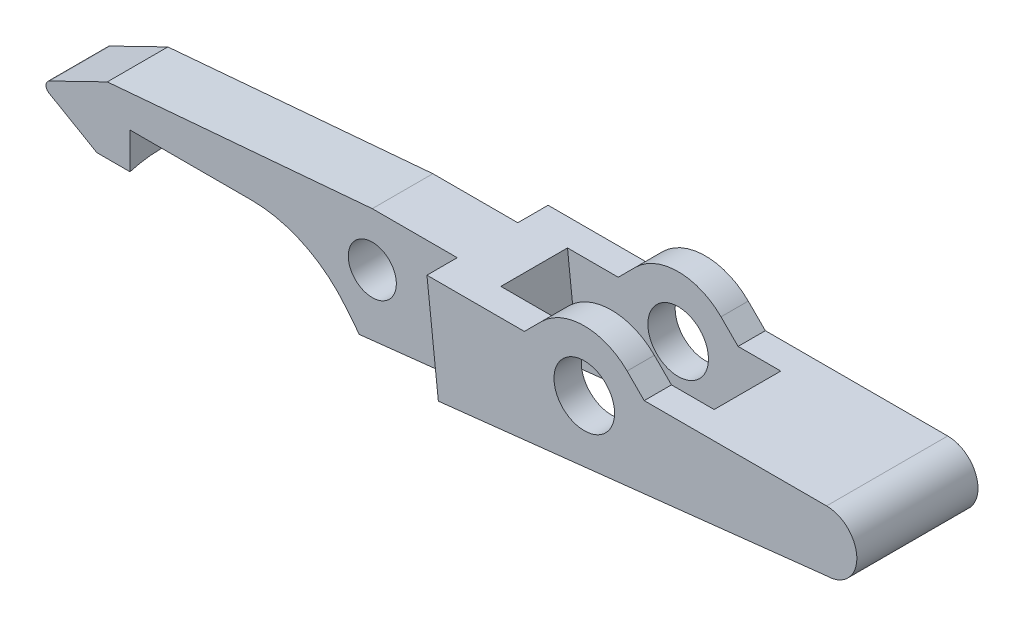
ISO-10303-21;
HEADER;
FILE_DESCRIPTION(('STEP AP214'),'2;1');
FILE_NAME('part.step','',(''),(''),'','','');
FILE_SCHEMA(('AUTOMOTIVE_DESIGN { 1 0 10303 214 1 1 1 1 }'));
ENDSEC;
DATA;
#1=APPLICATION_CONTEXT('core data for automotive mechanical design processes');
#2=APPLICATION_PROTOCOL_DEFINITION('international standard','automotive_design',2000,#1);
#3=PRODUCT_CONTEXT('',#1,'mechanical');
#4=PRODUCT('Part','Part','',(#3));
#5=PRODUCT_RELATED_PRODUCT_CATEGORY('part','',(#4));
#6=PRODUCT_DEFINITION_FORMATION('','',#4);
#7=PRODUCT_DEFINITION_CONTEXT('part definition',#1,'design');
#8=PRODUCT_DEFINITION('design','',#6,#7);
#9=PRODUCT_DEFINITION_SHAPE('','',#8);
#10=(LENGTH_UNIT() NAMED_UNIT(*) SI_UNIT(.MILLI.,.METRE.));
#11=(NAMED_UNIT(*) PLANE_ANGLE_UNIT() SI_UNIT($,.RADIAN.));
#12=(NAMED_UNIT(*) SI_UNIT($,.STERADIAN.) SOLID_ANGLE_UNIT());
#13=UNCERTAINTY_MEASURE_WITH_UNIT(LENGTH_MEASURE(1.E-05),#10,'distance_accuracy_value','');
#14=(GEOMETRIC_REPRESENTATION_CONTEXT(3) GLOBAL_UNCERTAINTY_ASSIGNED_CONTEXT((#13)) GLOBAL_UNIT_ASSIGNED_CONTEXT((#10,
#11,#12)) REPRESENTATION_CONTEXT('',''));
#15=CARTESIAN_POINT('',(0.,0.,0.));
#16=DIRECTION('',(0.,0.,1.));
#17=DIRECTION('',(1.,0.,0.));
#18=AXIS2_PLACEMENT_3D('',#15,#16,#17);
#19=CARTESIAN_POINT('',(8.70710678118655,1.15710678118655,2.));
#20=DIRECTION('',(-0.707106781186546,-0.707106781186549,0.));
#21=DIRECTION('',(0.707106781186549,-0.707106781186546,0.));
#22=AXIS2_PLACEMENT_3D('',#19,#20,#21);
#23=PLANE('',#22);
#24=DIRECTION('',(0.,0.,-1.));
#25=VECTOR('',#24,1.);
#26=CARTESIAN_POINT('',(8.9892135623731,0.875,2.));
#27=LINE('',#26,#25);
#28=CARTESIAN_POINT('',(8.9892135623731,0.875,2.));
#29=VERTEX_POINT('',#28);
#30=CARTESIAN_POINT('',(8.9892135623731,0.875000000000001,1.55));
#31=VERTEX_POINT('',#30);
#32=EDGE_CURVE('E419',#29,#31,#27,.T.);
#33=ORIENTED_EDGE('',*,*,#32,.T.);
#34=DIRECTION('',(-0.707106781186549,0.707106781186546,0.));
#35=VECTOR('',#34,1.);
#36=CARTESIAN_POINT('',(8.70710678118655,1.15710678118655,1.55));
#37=LINE('',#36,#35);
#38=CARTESIAN_POINT('',(8.70710678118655,1.15710678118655,1.55));
#39=VERTEX_POINT('',#38);
#40=EDGE_CURVE('E343',#31,#39,#37,.T.);
#41=ORIENTED_EDGE('',*,*,#40,.T.);
#42=DIRECTION('',(0.,0.,-1.));
#43=VECTOR('',#42,1.);
#44=CARTESIAN_POINT('',(8.70710678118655,1.15710678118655,2.));
#45=LINE('',#44,#43);
#46=CARTESIAN_POINT('',(8.70710678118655,1.15710678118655,2.));
#47=VERTEX_POINT('',#46);
#48=EDGE_CURVE('E415',#47,#39,#45,.T.);
#49=ORIENTED_EDGE('',*,*,#48,.F.);
#50=DIRECTION('',(-0.707106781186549,0.707106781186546,0.));
#51=VECTOR('',#50,1.);
#52=CARTESIAN_POINT('',(8.70710678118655,1.15710678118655,2.));
#53=LINE('',#52,#51);
#54=EDGE_CURVE('E371',#29,#47,#53,.T.);
#55=ORIENTED_EDGE('',*,*,#54,.F.);
#56=EDGE_LOOP('',(#33,#41,#49,#55));
#57=FACE_BOUND('',#56,.T.);
#58=ADVANCED_FACE('F33',(#57),#23,.F.);
#59=CARTESIAN_POINT('',(8.,0.45,2.));
#60=DIRECTION('',(0.,0.,-1.));
#61=DIRECTION('',(-1.,0.,0.));
#62=AXIS2_PLACEMENT_3D('',#59,#60,#61);
#63=CYLINDRICAL_SURFACE('',#62,1.);
#64=ORIENTED_EDGE('',*,*,#48,.T.);
#65=CARTESIAN_POINT('',(8.,0.45,1.55));
#66=DIRECTION('',(0.,0.,1.));
#67=DIRECTION('',(1.,0.,0.));
#68=AXIS2_PLACEMENT_3D('',#65,#66,#67);
#69=CIRCLE('',#68,1.);
#70=CARTESIAN_POINT('',(7.29289321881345,1.15710678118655,1.55));
#71=VERTEX_POINT('',#70);
#72=EDGE_CURVE('E340',#39,#71,#69,.T.);
#73=ORIENTED_EDGE('',*,*,#72,.T.);
#74=DIRECTION('',(0.,0.,-1.));
#75=VECTOR('',#74,1.);
#76=CARTESIAN_POINT('',(7.29289321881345,1.15710678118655,2.));
#77=LINE('',#76,#75);
#78=CARTESIAN_POINT('',(7.29289321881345,1.15710678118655,2.));
#79=VERTEX_POINT('',#78);
#80=EDGE_CURVE('E411',#79,#71,#77,.T.);
#81=ORIENTED_EDGE('',*,*,#80,.F.);
#82=CARTESIAN_POINT('',(8.,0.45,2.));
#83=DIRECTION('',(0.,0.,1.));
#84=DIRECTION('',(-1.,0.,0.));
#85=AXIS2_PLACEMENT_3D('',#82,#83,#84);
#86=CIRCLE('',#85,1.);
#87=EDGE_CURVE('E373',#47,#79,#86,.T.);
#88=ORIENTED_EDGE('',*,*,#87,.F.);
#89=EDGE_LOOP('',(#64,#73,#81,#88));
#90=FACE_BOUND('',#89,.T.);
#91=ADVANCED_FACE('F549',(#90),#63,.T.);
#92=CARTESIAN_POINT('',(7.0107864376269,0.875,2.));
#93=DIRECTION('',(0.707106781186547,-0.707106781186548,0.));
#94=DIRECTION('',(0.707106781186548,0.707106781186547,0.));
#95=AXIS2_PLACEMENT_3D('',#92,#93,#94);
#96=PLANE('',#95);
#97=ORIENTED_EDGE('',*,*,#80,.T.);
#98=DIRECTION('',(-0.707106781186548,-0.707106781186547,0.));
#99=VECTOR('',#98,1.);
#100=CARTESIAN_POINT('',(7.0107864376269,0.875,1.55));
#101=LINE('',#100,#99);
#102=CARTESIAN_POINT('',(7.0107864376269,0.875,1.55));
#103=VERTEX_POINT('',#102);
#104=EDGE_CURVE('E337',#71,#103,#101,.T.);
#105=ORIENTED_EDGE('',*,*,#104,.T.);
#106=DIRECTION('',(0.,0.,-1.));
#107=VECTOR('',#106,1.);
#108=CARTESIAN_POINT('',(7.0107864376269,0.875,2.));
#109=LINE('',#108,#107);
#110=CARTESIAN_POINT('',(7.0107864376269,0.875,2.));
#111=VERTEX_POINT('',#110);
#112=EDGE_CURVE('E407',#111,#103,#109,.T.);
#113=ORIENTED_EDGE('',*,*,#112,.F.);
#114=DIRECTION('',(-0.707106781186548,-0.707106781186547,0.));
#115=VECTOR('',#114,1.);
#116=CARTESIAN_POINT('',(7.0107864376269,0.875,2.));
#117=LINE('',#116,#115);
#118=EDGE_CURVE('E375',#79,#111,#117,.T.);
#119=ORIENTED_EDGE('',*,*,#118,.F.);
#120=EDGE_LOOP('',(#97,#105,#113,#119));
#121=FACE_BOUND('',#120,.T.);
#122=ADVANCED_FACE('F553',(#121),#96,.F.);
#123=CARTESIAN_POINT('',(8.,0.45,2.));
#124=DIRECTION('',(0.,0.,-1.));
#125=DIRECTION('',(-1.,0.,0.));
#126=AXIS2_PLACEMENT_3D('',#123,#124,#125);
#127=CYLINDRICAL_SURFACE('',#126,0.500000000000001);
#128=CARTESIAN_POINT('',(8.,0.45,1.55));
#129=DIRECTION('',(0.,0.,1.));
#130=DIRECTION('',(1.,0.,0.));
#131=AXIS2_PLACEMENT_3D('',#128,#129,#130);
#132=CIRCLE('',#131,0.500000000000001);
#133=CARTESIAN_POINT('',(8.5,0.45,1.55));
#134=VERTEX_POINT('',#133);
#135=EDGE_CURVE('E333',#134,#134,#132,.T.);
#136=ORIENTED_EDGE('',*,*,#135,.F.);
#137=EDGE_LOOP('',(#136));
#138=FACE_BOUND('',#137,.T.);
#139=CARTESIAN_POINT('',(8.,0.45,2.));
#140=DIRECTION('',(0.,0.,1.));
#141=DIRECTION('',(1.,0.,0.));
#142=AXIS2_PLACEMENT_3D('',#139,#140,#141);
#143=CIRCLE('',#142,0.500000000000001);
#144=CARTESIAN_POINT('',(8.5,0.45,2.));
#145=VERTEX_POINT('',#144);
#146=EDGE_CURVE('E358',#145,#145,#143,.T.);
#147=ORIENTED_EDGE('',*,*,#146,.T.);
#148=EDGE_LOOP('',(#147));
#149=FACE_BOUND('',#148,.T.);
#150=ADVANCED_FACE('F555',(#138,#149),#127,.F.);
#151=CARTESIAN_POINT('',(8.,0.45,2.));
#152=DIRECTION('',(0.,0.,-1.));
#153=DIRECTION('',(-1.,0.,0.));
#154=AXIS2_PLACEMENT_3D('',#151,#152,#153);
#155=PLANE('',#154);
#156=DIRECTION('',(-1.,0.,0.));
#157=VECTOR('',#156,1.);
#158=CARTESIAN_POINT('',(4.,0.875000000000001,2.));
#159=LINE('',#158,#157);
#160=CARTESIAN_POINT('',(5.40237223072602,0.875000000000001,2.));
#161=VERTEX_POINT('',#160);
#162=EDGE_CURVE('E377',#111,#161,#159,.T.);
#163=ORIENTED_EDGE('',*,*,#162,.T.);
#164=DIRECTION('',(0.109638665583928,-0.99397151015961,0.));
#165=VECTOR('',#164,1.);
#166=CARTESIAN_POINT('',(5.47991289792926,0.172025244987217,2.));
#167=LINE('',#166,#165);
#168=CARTESIAN_POINT('',(5.59065762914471,-0.831973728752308,2.));
#169=VERTEX_POINT('',#168);
#170=EDGE_CURVE('E351',#161,#169,#167,.T.);
#171=ORIENTED_EDGE('',*,*,#170,.T.);
#172=DIRECTION('',(0.99397151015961,0.109638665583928,0.));
#173=VECTOR('',#172,1.);
#174=CARTESIAN_POINT('',(12.,-0.124999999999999,2.));
#175=LINE('',#174,#173);
#176=CARTESIAN_POINT('',(12.,-0.124999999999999,2.));
#177=VERTEX_POINT('',#176);
#178=EDGE_CURVE('E364',#169,#177,#175,.T.);
#179=ORIENTED_EDGE('',*,*,#178,.T.);
#180=CARTESIAN_POINT('',(12.,0.375000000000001,2.));
#181=DIRECTION('',(0.,0.,1.));
#182=DIRECTION('',(1.,0.,0.));
#183=AXIS2_PLACEMENT_3D('',#180,#181,#182);
#184=CIRCLE('',#183,0.5);
#185=CARTESIAN_POINT('',(12.,0.875000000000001,2.));
#186=VERTEX_POINT('',#185);
#187=EDGE_CURVE('E366',#177,#186,#184,.T.);
#188=ORIENTED_EDGE('',*,*,#187,.T.);
#189=DIRECTION('',(-1.,0.,0.));
#190=VECTOR('',#189,1.);
#191=CARTESIAN_POINT('',(8.9892135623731,0.875,2.));
#192=LINE('',#191,#190);
#193=EDGE_CURVE('E369',#186,#29,#192,.T.);
#194=ORIENTED_EDGE('',*,*,#193,.T.);
#195=ORIENTED_EDGE('',*,*,#54,.T.);
#196=ORIENTED_EDGE('',*,*,#87,.T.);
#197=ORIENTED_EDGE('',*,*,#118,.T.);
#198=EDGE_LOOP('',(#163,#171,#179,#188,#194,#195,#196,#197));
#199=FACE_BOUND('',#198,.T.);
#200=ORIENTED_EDGE('',*,*,#146,.F.);
#201=EDGE_LOOP('',(#200));
#202=FACE_BOUND('',#201,.T.);
#203=ADVANCED_FACE('F536',(#199,#202),#155,.F.);
#204=CARTESIAN_POINT('',(8.,0.45,0.));
#205=DIRECTION('',(0.,0.,-1.));
#206=DIRECTION('',(-1.,0.,0.));
#207=AXIS2_PLACEMENT_3D('',#204,#205,#206);
#208=PLANE('',#207);
#209=DIRECTION('',(0.109638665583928,-0.99397151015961,0.));
#210=VECTOR('',#209,1.);
#211=CARTESIAN_POINT('',(5.47991289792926,0.172025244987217,0.));
#212=LINE('',#211,#210);
#213=CARTESIAN_POINT('',(5.40237223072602,0.875000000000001,0.));
#214=VERTEX_POINT('',#213);
#215=CARTESIAN_POINT('',(5.59065762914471,-0.831973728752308,0.));
#216=VERTEX_POINT('',#215);
#217=EDGE_CURVE('E349',#214,#216,#212,.T.);
#218=ORIENTED_EDGE('',*,*,#217,.F.);
#219=DIRECTION('',(-1.,0.,0.));
#220=VECTOR('',#219,1.);
#221=CARTESIAN_POINT('',(4.,0.875000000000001,0.));
#222=LINE('',#221,#220);
#223=CARTESIAN_POINT('',(7.0107864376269,0.875,0.));
#224=VERTEX_POINT('',#223);
#225=EDGE_CURVE('E367',#224,#214,#222,.T.);
#226=ORIENTED_EDGE('',*,*,#225,.F.);
#227=DIRECTION('',(-0.707106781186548,-0.707106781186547,0.));
#228=VECTOR('',#227,1.);
#229=CARTESIAN_POINT('',(7.0107864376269,0.875,0.));
#230=LINE('',#229,#228);
#231=CARTESIAN_POINT('',(7.29289321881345,1.15710678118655,0.));
#232=VERTEX_POINT('',#231);
#233=EDGE_CURVE('E393',#232,#224,#230,.T.);
#234=ORIENTED_EDGE('',*,*,#233,.F.);
#235=CARTESIAN_POINT('',(8.,0.45,0.));
#236=DIRECTION('',(0.,0.,1.));
#237=DIRECTION('',(-1.,0.,0.));
#238=AXIS2_PLACEMENT_3D('',#235,#236,#237);
#239=CIRCLE('',#238,1.);
#240=CARTESIAN_POINT('',(8.70710678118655,1.15710678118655,0.));
#241=VERTEX_POINT('',#240);
#242=EDGE_CURVE('E390',#241,#232,#239,.T.);
#243=ORIENTED_EDGE('',*,*,#242,.F.);
#244=DIRECTION('',(-0.707106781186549,0.707106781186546,0.));
#245=VECTOR('',#244,1.);
#246=CARTESIAN_POINT('',(8.70710678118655,1.15710678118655,0.));
#247=LINE('',#246,#245);
#248=CARTESIAN_POINT('',(8.9892135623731,0.875,0.));
#249=VERTEX_POINT('',#248);
#250=EDGE_CURVE('E387',#249,#241,#247,.T.);
#251=ORIENTED_EDGE('',*,*,#250,.F.);
#252=DIRECTION('',(-1.,0.,0.));
#253=VECTOR('',#252,1.);
#254=CARTESIAN_POINT('',(8.9892135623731,0.875,0.));
#255=LINE('',#254,#253);
#256=CARTESIAN_POINT('',(12.,0.875000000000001,0.));
#257=VERTEX_POINT('',#256);
#258=EDGE_CURVE('E384',#257,#249,#255,.T.);
#259=ORIENTED_EDGE('',*,*,#258,.F.);
#260=CARTESIAN_POINT('',(12.,0.375000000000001,0.));
#261=DIRECTION('',(0.,0.,1.));
#262=DIRECTION('',(1.,0.,0.));
#263=AXIS2_PLACEMENT_3D('',#260,#261,#262);
#264=CIRCLE('',#263,0.5);
#265=CARTESIAN_POINT('',(12.,-0.124999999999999,0.));
#266=VERTEX_POINT('',#265);
#267=EDGE_CURVE('E382',#266,#257,#264,.T.);
#268=ORIENTED_EDGE('',*,*,#267,.F.);
#269=DIRECTION('',(0.99397151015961,0.109638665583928,0.));
#270=VECTOR('',#269,1.);
#271=CARTESIAN_POINT('',(12.,-0.124999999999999,0.));
#272=LINE('',#271,#270);
#273=EDGE_CURVE('E361',#216,#266,#272,.T.);
#274=ORIENTED_EDGE('',*,*,#273,.F.);
#275=EDGE_LOOP('',(#218,#226,#234,#243,#251,#259,#268,#274));
#276=FACE_BOUND('',#275,.T.);
#277=CARTESIAN_POINT('',(8.,0.45,0.));
#278=DIRECTION('',(0.,0.,1.));
#279=DIRECTION('',(1.,0.,0.));
#280=AXIS2_PLACEMENT_3D('',#277,#278,#279);
#281=CIRCLE('',#280,0.500000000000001);
#282=CARTESIAN_POINT('',(8.5,0.45,0.));
#283=VERTEX_POINT('',#282);
#284=EDGE_CURVE('E357',#283,#283,#281,.T.);
#285=ORIENTED_EDGE('',*,*,#284,.T.);
#286=EDGE_LOOP('',(#285));
#287=FACE_BOUND('',#286,.T.);
#288=ADVANCED_FACE('F485',(#276,#287),#208,.T.);
#289=CARTESIAN_POINT('',(2.,0.,2.));
#290=DIRECTION('',(0.,1.,0.));
#291=DIRECTION('',(-1.,0.,0.));
#292=AXIS2_PLACEMENT_3D('',#289,#290,#291);
#293=PLANE('',#292);
#294=DIRECTION('',(0.,0.,-1.));
#295=VECTOR('',#294,1.);
#296=CARTESIAN_POINT('',(2.,0.,2.));
#297=LINE('',#296,#295);
#298=CARTESIAN_POINT('',(2.,0.,1.5));
#299=VERTEX_POINT('',#298);
#300=CARTESIAN_POINT('',(2.,0.,0.5));
#301=VERTEX_POINT('',#300);
#302=EDGE_CURVE('E434',#299,#301,#297,.T.);
#303=ORIENTED_EDGE('',*,*,#302,.F.);
#304=DIRECTION('',(-1.,0.,0.));
#305=VECTOR('',#304,1.);
#306=CARTESIAN_POINT('',(2.,0.,1.5));
#307=LINE('',#306,#305);
#308=CARTESIAN_POINT('',(0.,0.,1.5));
#309=VERTEX_POINT('',#308);
#310=EDGE_CURVE('E309',#299,#309,#307,.T.);
#311=ORIENTED_EDGE('',*,*,#310,.T.);
#312=DIRECTION('',(0.,0.,-1.));
#313=VECTOR('',#312,1.);
#314=CARTESIAN_POINT('',(0.,0.,2.));
#315=LINE('',#314,#313);
#316=CARTESIAN_POINT('',(0.,0.,0.5));
#317=VERTEX_POINT('',#316);
#318=EDGE_CURVE('E380',#309,#317,#315,.T.);
#319=ORIENTED_EDGE('',*,*,#318,.T.);
#320=DIRECTION('',(1.,0.,0.));
#321=VECTOR('',#320,1.);
#322=CARTESIAN_POINT('',(2.,0.,0.5));
#323=LINE('',#322,#321);
#324=EDGE_CURVE('E279',#317,#301,#323,.T.);
#325=ORIENTED_EDGE('',*,*,#324,.T.);
#326=EDGE_LOOP('',(#303,#311,#319,#325));
#327=FACE_BOUND('',#326,.T.);
#328=ADVANCED_FACE('F507',(#327),#293,.F.);
#329=CARTESIAN_POINT('',(2.,-2.,2.));
#330=DIRECTION('',(0.,0.,-1.));
#331=DIRECTION('',(-1.,0.,0.));
#332=AXIS2_PLACEMENT_3D('',#329,#330,#331);
#333=CYLINDRICAL_SURFACE('',#332,2.);
#334=DIRECTION('',(0.,0.,-1.));
#335=VECTOR('',#334,1.);
#336=CARTESIAN_POINT('',(3.56133004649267,-0.75010060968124,2.));
#337=LINE('',#336,#335);
#338=CARTESIAN_POINT('',(3.56133004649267,-0.75010060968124,1.5));
#339=VERTEX_POINT('',#338);
#340=CARTESIAN_POINT('',(3.56133004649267,-0.75010060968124,0.5));
#341=VERTEX_POINT('',#340);
#342=EDGE_CURVE('E431',#339,#341,#337,.T.);
#343=ORIENTED_EDGE('',*,*,#342,.F.);
#344=CARTESIAN_POINT('',(2.,-2.,1.5));
#345=DIRECTION('',(0.,0.,-1.));
#346=DIRECTION('',(-1.,0.,0.));
#347=AXIS2_PLACEMENT_3D('',#344,#345,#346);
#348=CIRCLE('',#347,2.);
#349=EDGE_CURVE('E312',#339,#299,#348,.F.);
#350=ORIENTED_EDGE('',*,*,#349,.T.);
#351=ORIENTED_EDGE('',*,*,#302,.T.);
#352=CARTESIAN_POINT('',(2.,-2.,0.5));
#353=DIRECTION('',(0.,0.,1.));
#354=DIRECTION('',(1.,0.,0.));
#355=AXIS2_PLACEMENT_3D('',#352,#353,#354);
#356=CIRCLE('',#355,2.);
#357=EDGE_CURVE('E282',#301,#341,#356,.F.);
#358=ORIENTED_EDGE('',*,*,#357,.T.);
#359=EDGE_LOOP('',(#343,#350,#351,#358));
#360=FACE_BOUND('',#359,.T.);
#361=ADVANCED_FACE('F504',(#360),#333,.F.);
#362=CARTESIAN_POINT('',(3.78620865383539,-1.03101100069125,2.));
#363=DIRECTION('',(0.780665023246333,0.624949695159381,0.));
#364=DIRECTION('',(-0.624949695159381,0.780665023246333,0.));
#365=AXIS2_PLACEMENT_3D('',#362,#363,#364);
#366=PLANE('',#365);
#367=DIRECTION('',(0.,0.,-1.));
#368=VECTOR('',#367,1.);
#369=CARTESIAN_POINT('',(3.78620865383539,-1.03101100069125,2.));
#370=LINE('',#369,#368);
#371=CARTESIAN_POINT('',(3.78620865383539,-1.03101100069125,1.5));
#372=VERTEX_POINT('',#371);
#373=CARTESIAN_POINT('',(3.78620865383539,-1.03101100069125,0.5));
#374=VERTEX_POINT('',#373);
#375=EDGE_CURVE('E428',#372,#374,#370,.T.);
#376=ORIENTED_EDGE('',*,*,#375,.F.);
#377=DIRECTION('',(-0.624949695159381,0.780665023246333,0.));
#378=VECTOR('',#377,1.);
#379=CARTESIAN_POINT('',(3.78620865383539,-1.03101100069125,1.5));
#380=LINE('',#379,#378);
#381=EDGE_CURVE('E315',#372,#339,#380,.T.);
#382=ORIENTED_EDGE('',*,*,#381,.T.);
#383=ORIENTED_EDGE('',*,*,#342,.T.);
#384=DIRECTION('',(0.624949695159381,-0.780665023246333,0.));
#385=VECTOR('',#384,1.);
#386=CARTESIAN_POINT('',(3.78620865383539,-1.03101100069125,0.5));
#387=LINE('',#386,#385);
#388=EDGE_CURVE('E285',#341,#374,#387,.T.);
#389=ORIENTED_EDGE('',*,*,#388,.T.);
#390=EDGE_LOOP('',(#376,#382,#383,#389));
#391=FACE_BOUND('',#390,.T.);
#392=ADVANCED_FACE('F501',(#391),#366,.F.);
#393=CARTESIAN_POINT('',(12.,-0.124999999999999,2.));
#394=DIRECTION('',(-0.109638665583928,0.99397151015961,0.));
#395=DIRECTION('',(-0.99397151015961,-0.109638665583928,0.));
#396=AXIS2_PLACEMENT_3D('',#393,#394,#395);
#397=PLANE('',#396);
#398=DIRECTION('',(0.99397151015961,0.109638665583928,0.));
#399=VECTOR('',#398,1.);
#400=CARTESIAN_POINT('',(6.35177930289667,-0.748019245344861,0.45));
#401=LINE('',#400,#399);
#402=CARTESIAN_POINT('',(6.35177930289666,-0.748019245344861,0.45));
#403=VERTEX_POINT('',#402);
#404=CARTESIAN_POINT('',(9.8306795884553,-0.364283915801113,0.45));
#405=VERTEX_POINT('',#404);
#406=EDGE_CURVE('E231',#403,#405,#401,.T.);
#407=ORIENTED_EDGE('',*,*,#406,.F.);
#408=DIRECTION('',(0.,0.,-1.));
#409=VECTOR('',#408,1.);
#410=CARTESIAN_POINT('',(6.35177930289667,-0.748019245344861,1.55));
#411=LINE('',#410,#409);
#412=CARTESIAN_POINT('',(6.35177930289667,-0.748019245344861,1.55));
#413=VERTEX_POINT('',#412);
#414=EDGE_CURVE('E48',#413,#403,#411,.T.);
#415=ORIENTED_EDGE('',*,*,#414,.F.);
#416=DIRECTION('',(-0.99397151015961,-0.109638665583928,0.));
#417=VECTOR('',#416,1.);
#418=CARTESIAN_POINT('',(6.35177930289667,-0.748019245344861,1.55));
#419=LINE('',#418,#417);
#420=CARTESIAN_POINT('',(9.8306795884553,-0.364283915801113,1.55));
#421=VERTEX_POINT('',#420);
#422=EDGE_CURVE('E238',#421,#413,#419,.T.);
#423=ORIENTED_EDGE('',*,*,#422,.F.);
#424=DIRECTION('',(0.,0.,1.));
#425=VECTOR('',#424,1.);
#426=CARTESIAN_POINT('',(9.8306795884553,-0.364283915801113,1.55));
#427=LINE('',#426,#425);
#428=EDGE_CURVE('E224',#405,#421,#427,.T.);
#429=ORIENTED_EDGE('',*,*,#428,.F.);
#430=EDGE_LOOP('',(#407,#415,#423,#429));
#431=FACE_BOUND('',#430,.T.);
#432=ORIENTED_EDGE('',*,*,#178,.F.);
#433=DIRECTION('',(0.,0.,1.));
#434=VECTOR('',#433,1.);
#435=CARTESIAN_POINT('',(5.59065762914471,-0.831973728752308,3.06410076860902));
#436=LINE('',#435,#434);
#437=CARTESIAN_POINT('',(5.59065762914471,-0.831973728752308,1.5));
#438=VERTEX_POINT('',#437);
#439=EDGE_CURVE('E251',#438,#169,#436,.T.);
#440=ORIENTED_EDGE('',*,*,#439,.F.);
#441=DIRECTION('',(0.99397151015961,0.109638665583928,0.));
#442=VECTOR('',#441,1.);
#443=CARTESIAN_POINT('',(-2.52201627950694,-1.72683110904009,1.5));
#444=LINE('',#443,#442);
#445=EDGE_CURVE('E248',#372,#438,#444,.T.);
#446=ORIENTED_EDGE('',*,*,#445,.F.);
#447=ORIENTED_EDGE('',*,*,#375,.T.);
#448=DIRECTION('',(-0.99397151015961,-0.109638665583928,0.));
#449=VECTOR('',#448,1.);
#450=CARTESIAN_POINT('',(-2.52201627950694,-1.72683110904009,0.5));
#451=LINE('',#450,#449);
#452=CARTESIAN_POINT('',(5.59065762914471,-0.831973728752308,0.5));
#453=VERTEX_POINT('',#452);
#454=EDGE_CURVE('E258',#453,#374,#451,.T.);
#455=ORIENTED_EDGE('',*,*,#454,.F.);
#456=DIRECTION('',(0.,0.,1.));
#457=VECTOR('',#456,1.);
#458=CARTESIAN_POINT('',(5.59065762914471,-0.831973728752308,0.5));
#459=LINE('',#458,#457);
#460=EDGE_CURVE('E256',#216,#453,#459,.T.);
#461=ORIENTED_EDGE('',*,*,#460,.F.);
#462=ORIENTED_EDGE('',*,*,#273,.T.);
#463=DIRECTION('',(0.,0.,-1.));
#464=VECTOR('',#463,1.);
#465=CARTESIAN_POINT('',(12.,-0.124999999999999,2.));
#466=LINE('',#465,#464);
#467=EDGE_CURVE('E425',#177,#266,#466,.T.);
#468=ORIENTED_EDGE('',*,*,#467,.F.);
#469=EDGE_LOOP('',(#432,#440,#446,#447,#455,#461,#462,#468));
#470=FACE_BOUND('',#469,.T.);
#471=ADVANCED_FACE('F235',(#431,#470),#397,.F.);
#472=CARTESIAN_POINT('',(12.,0.375000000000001,2.));
#473=DIRECTION('',(0.,0.,-1.));
#474=DIRECTION('',(-1.,0.,0.));
#475=AXIS2_PLACEMENT_3D('',#472,#473,#474);
#476=CYLINDRICAL_SURFACE('',#475,0.5);
#477=ORIENTED_EDGE('',*,*,#267,.T.);
#478=DIRECTION('',(0.,0.,-1.));
#479=VECTOR('',#478,1.);
#480=CARTESIAN_POINT('',(12.,0.875000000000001,2.));
#481=LINE('',#480,#479);
#482=EDGE_CURVE('E422',#186,#257,#481,.T.);
#483=ORIENTED_EDGE('',*,*,#482,.F.);
#484=ORIENTED_EDGE('',*,*,#187,.F.);
#485=ORIENTED_EDGE('',*,*,#467,.T.);
#486=EDGE_LOOP('',(#477,#483,#484,#485));
#487=FACE_BOUND('',#486,.T.);
#488=ADVANCED_FACE('F541',(#487),#476,.T.);
#489=CARTESIAN_POINT('',(8.9892135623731,0.875,2.));
#490=DIRECTION('',(0.,-1.,0.));
#491=DIRECTION('',(1.,0.,0.));
#492=AXIS2_PLACEMENT_3D('',#489,#490,#491);
#493=PLANE('',#492);
#494=DIRECTION('',(0.,0.,1.));
#495=VECTOR('',#494,1.);
#496=CARTESIAN_POINT('',(9.69398207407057,0.875,2.));
#497=LINE('',#496,#495);
#498=CARTESIAN_POINT('',(9.69398207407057,0.875000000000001,0.45));
#499=VERTEX_POINT('',#498);
#500=CARTESIAN_POINT('',(9.69398207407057,0.875,1.55));
#501=VERTEX_POINT('',#500);
#502=EDGE_CURVE('E11',#499,#501,#497,.T.);
#503=ORIENTED_EDGE('',*,*,#502,.T.);
#504=DIRECTION('',(-1.,0.,0.));
#505=VECTOR('',#504,1.);
#506=CARTESIAN_POINT('',(8.9892135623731,0.875,1.55));
#507=LINE('',#506,#505);
#508=EDGE_CURVE('E346',#501,#31,#507,.T.);
#509=ORIENTED_EDGE('',*,*,#508,.T.);
#510=ORIENTED_EDGE('',*,*,#32,.F.);
#511=ORIENTED_EDGE('',*,*,#193,.F.);
#512=ORIENTED_EDGE('',*,*,#482,.T.);
#513=ORIENTED_EDGE('',*,*,#258,.T.);
#514=CARTESIAN_POINT('',(8.9892135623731,0.875000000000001,0.45));
#515=VERTEX_POINT('',#514);
#516=EDGE_CURVE('E418',#515,#249,#27,.T.);
#517=ORIENTED_EDGE('',*,*,#516,.F.);
#518=DIRECTION('',(1.,0.,0.));
#519=VECTOR('',#518,1.);
#520=CARTESIAN_POINT('',(8.9892135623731,0.875,0.45));
#521=LINE('',#520,#519);
#522=EDGE_CURVE('E331',#515,#499,#521,.T.);
#523=ORIENTED_EDGE('',*,*,#522,.T.);
#524=EDGE_LOOP('',(#503,#509,#510,#511,#512,#513,#517,#523));
#525=FACE_BOUND('',#524,.T.);
#526=ADVANCED_FACE('F468',(#525),#493,.F.);
#527=CARTESIAN_POINT('',(8.70710678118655,1.15710678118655,0.45));
#528=VERTEX_POINT('',#527);
#529=EDGE_CURVE('E414',#528,#241,#45,.T.);
#530=ORIENTED_EDGE('',*,*,#529,.F.);
#531=DIRECTION('',(0.707106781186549,-0.707106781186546,0.));
#532=VECTOR('',#531,1.);
#533=CARTESIAN_POINT('',(8.70710678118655,1.15710678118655,0.45));
#534=LINE('',#533,#532);
#535=EDGE_CURVE('E328',#528,#515,#534,.T.);
#536=ORIENTED_EDGE('',*,*,#535,.T.);
#537=ORIENTED_EDGE('',*,*,#516,.T.);
#538=ORIENTED_EDGE('',*,*,#250,.T.);
#539=EDGE_LOOP('',(#530,#536,#537,#538));
#540=FACE_BOUND('',#539,.T.);
#541=ADVANCED_FACE('F473',(#540),#23,.F.);
#542=CARTESIAN_POINT('',(7.29289321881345,1.15710678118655,0.45));
#543=VERTEX_POINT('',#542);
#544=EDGE_CURVE('E410',#543,#232,#77,.T.);
#545=ORIENTED_EDGE('',*,*,#544,.F.);
#546=CARTESIAN_POINT('',(8.,0.45,0.45));
#547=DIRECTION('',(0.,0.,-1.));
#548=DIRECTION('',(-1.,0.,0.));
#549=AXIS2_PLACEMENT_3D('',#546,#547,#548);
#550=CIRCLE('',#549,1.);
#551=EDGE_CURVE('E325',#543,#528,#550,.T.);
#552=ORIENTED_EDGE('',*,*,#551,.T.);
#553=ORIENTED_EDGE('',*,*,#529,.T.);
#554=ORIENTED_EDGE('',*,*,#242,.T.);
#555=EDGE_LOOP('',(#545,#552,#553,#554));
#556=FACE_BOUND('',#555,.T.);
#557=ADVANCED_FACE('F478',(#556),#63,.T.);
#558=CARTESIAN_POINT('',(7.0107864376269,0.875,0.45));
#559=VERTEX_POINT('',#558);
#560=EDGE_CURVE('E406',#559,#224,#109,.T.);
#561=ORIENTED_EDGE('',*,*,#560,.F.);
#562=DIRECTION('',(0.707106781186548,0.707106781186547,0.));
#563=VECTOR('',#562,1.);
#564=CARTESIAN_POINT('',(7.0107864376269,0.875,0.45));
#565=LINE('',#564,#563);
#566=EDGE_CURVE('E56',#559,#543,#565,.T.);
#567=ORIENTED_EDGE('',*,*,#566,.T.);
#568=ORIENTED_EDGE('',*,*,#544,.T.);
#569=ORIENTED_EDGE('',*,*,#233,.T.);
#570=EDGE_LOOP('',(#561,#567,#568,#569));
#571=FACE_BOUND('',#570,.T.);
#572=ADVANCED_FACE('F481',(#571),#96,.F.);
#573=CARTESIAN_POINT('',(4.,0.875000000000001,2.));
#574=DIRECTION('',(0.,-1.,0.));
#575=DIRECTION('',(1.,0.,0.));
#576=AXIS2_PLACEMENT_3D('',#573,#574,#575);
#577=PLANE('',#576);
#578=ORIENTED_EDGE('',*,*,#112,.T.);
#579=DIRECTION('',(-1.,0.,0.));
#580=VECTOR('',#579,1.);
#581=CARTESIAN_POINT('',(4.,0.875000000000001,1.55));
#582=LINE('',#581,#580);
#583=CARTESIAN_POINT('',(6.17275438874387,0.875000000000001,1.55));
#584=VERTEX_POINT('',#583);
#585=EDGE_CURVE('E334',#103,#584,#582,.T.);
#586=ORIENTED_EDGE('',*,*,#585,.T.);
#587=DIRECTION('',(0.,0.,-1.));
#588=VECTOR('',#587,1.);
#589=CARTESIAN_POINT('',(6.17275438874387,0.875000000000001,2.));
#590=LINE('',#589,#588);
#591=CARTESIAN_POINT('',(6.17275438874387,0.875000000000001,0.45));
#592=VERTEX_POINT('',#591);
#593=EDGE_CURVE('E41',#584,#592,#590,.T.);
#594=ORIENTED_EDGE('',*,*,#593,.T.);
#595=DIRECTION('',(1.,0.,0.));
#596=VECTOR('',#595,1.);
#597=CARTESIAN_POINT('',(4.,0.875000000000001,0.45));
#598=LINE('',#597,#596);
#599=EDGE_CURVE('E322',#592,#559,#598,.T.);
#600=ORIENTED_EDGE('',*,*,#599,.T.);
#601=ORIENTED_EDGE('',*,*,#560,.T.);
#602=ORIENTED_EDGE('',*,*,#225,.T.);
#603=DIRECTION('',(0.,0.,1.));
#604=VECTOR('',#603,1.);
#605=CARTESIAN_POINT('',(5.40237223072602,0.875000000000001,2.));
#606=LINE('',#605,#604);
#607=CARTESIAN_POINT('',(5.40237223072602,0.875,0.5));
#608=VERTEX_POINT('',#607);
#609=EDGE_CURVE('E450',#214,#608,#606,.T.);
#610=ORIENTED_EDGE('',*,*,#609,.T.);
#611=DIRECTION('',(-1.,0.,0.));
#612=VECTOR('',#611,1.);
#613=CARTESIAN_POINT('',(4.,0.875000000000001,0.5));
#614=LINE('',#613,#612);
#615=CARTESIAN_POINT('',(4.,0.875000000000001,0.5));
#616=VERTEX_POINT('',#615);
#617=EDGE_CURVE('E270',#608,#616,#614,.T.);
#618=ORIENTED_EDGE('',*,*,#617,.T.);
#619=DIRECTION('',(0.,0.,-1.));
#620=VECTOR('',#619,1.);
#621=CARTESIAN_POINT('',(4.,0.875000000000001,2.));
#622=LINE('',#621,#620);
#623=CARTESIAN_POINT('',(4.,0.875000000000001,1.5));
#624=VERTEX_POINT('',#623);
#625=EDGE_CURVE('E403',#624,#616,#622,.T.);
#626=ORIENTED_EDGE('',*,*,#625,.F.);
#627=DIRECTION('',(1.,0.,0.));
#628=VECTOR('',#627,1.);
#629=CARTESIAN_POINT('',(4.,0.875000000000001,1.5));
#630=LINE('',#629,#628);
#631=CARTESIAN_POINT('',(5.40237223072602,0.875000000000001,1.5));
#632=VERTEX_POINT('',#631);
#633=EDGE_CURVE('E300',#624,#632,#630,.T.);
#634=ORIENTED_EDGE('',*,*,#633,.T.);
#635=DIRECTION('',(0.,0.,1.));
#636=VECTOR('',#635,1.);
#637=CARTESIAN_POINT('',(5.40237223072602,0.875000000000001,2.));
#638=LINE('',#637,#636);
#639=EDGE_CURVE('E457',#632,#161,#638,.T.);
#640=ORIENTED_EDGE('',*,*,#639,.T.);
#641=ORIENTED_EDGE('',*,*,#162,.F.);
#642=EDGE_LOOP('',(#578,#586,#594,#600,#601,#602,#610,#618,#626,#634,#640,#641));
#643=FACE_BOUND('',#642,.T.);
#644=ADVANCED_FACE('F461',(#643),#577,.F.);
#645=CARTESIAN_POINT('',(-0.375,0.5,2.));
#646=DIRECTION('',(0.0854011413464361,-0.996346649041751,0.));
#647=DIRECTION('',(0.996346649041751,0.0854011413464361,0.));
#648=AXIS2_PLACEMENT_3D('',#645,#646,#647);
#649=PLANE('',#648);
#650=DIRECTION('',(0.,0.,-1.));
#651=VECTOR('',#650,1.);
#652=CARTESIAN_POINT('',(-0.375,0.5,2.));
#653=LINE('',#652,#651);
#654=CARTESIAN_POINT('',(-0.375,0.5,1.5));
#655=VERTEX_POINT('',#654);
#656=CARTESIAN_POINT('',(-0.375,0.5,0.5));
#657=VERTEX_POINT('',#656);
#658=EDGE_CURVE('E400',#655,#657,#653,.T.);
#659=ORIENTED_EDGE('',*,*,#658,.F.);
#660=DIRECTION('',(0.996346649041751,0.0854011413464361,0.));
#661=VECTOR('',#660,1.);
#662=CARTESIAN_POINT('',(-0.375,0.5,1.5));
#663=LINE('',#662,#661);
#664=EDGE_CURVE('E297',#655,#624,#663,.T.);
#665=ORIENTED_EDGE('',*,*,#664,.T.);
#666=ORIENTED_EDGE('',*,*,#625,.T.);
#667=DIRECTION('',(-0.996346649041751,-0.0854011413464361,0.));
#668=VECTOR('',#667,1.);
#669=CARTESIAN_POINT('',(-0.375,0.5,0.5));
#670=LINE('',#669,#668);
#671=EDGE_CURVE('E267',#616,#657,#670,.T.);
#672=ORIENTED_EDGE('',*,*,#671,.T.);
#673=EDGE_LOOP('',(#659,#665,#666,#672));
#674=FACE_BOUND('',#673,.T.);
#675=ADVANCED_FACE('F526',(#674),#649,.F.);
#676=CARTESIAN_POINT('',(-1.5,-0.0476497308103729,2.));
#677=DIRECTION('',(0.437693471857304,-0.899124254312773,0.));
#678=DIRECTION('',(0.899124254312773,0.437693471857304,0.));
#679=AXIS2_PLACEMENT_3D('',#676,#677,#678);
#680=PLANE('',#679);
#681=DIRECTION('',(0.,0.,-1.));
#682=VECTOR('',#681,1.);
#683=CARTESIAN_POINT('',(-1.33074544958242,0.0347433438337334,2.));
#684=LINE('',#683,#682);
#685=CARTESIAN_POINT('',(-1.33074544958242,0.0347433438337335,0.5));
#686=VERTEX_POINT('',#685);
#687=CARTESIAN_POINT('',(-1.33074544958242,0.0347433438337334,1.5));
#688=VERTEX_POINT('',#687);
#689=EDGE_CURVE('E443',#686,#688,#684,.F.);
#690=ORIENTED_EDGE('',*,*,#689,.T.);
#691=DIRECTION('',(0.899124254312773,0.437693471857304,0.));
#692=VECTOR('',#691,1.);
#693=CARTESIAN_POINT('',(-1.5,-0.0476497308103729,1.5));
#694=LINE('',#693,#692);
#695=EDGE_CURVE('E294',#688,#655,#694,.T.);
#696=ORIENTED_EDGE('',*,*,#695,.T.);
#697=ORIENTED_EDGE('',*,*,#658,.T.);
#698=DIRECTION('',(-0.899124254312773,-0.437693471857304,0.));
#699=VECTOR('',#698,1.);
#700=CARTESIAN_POINT('',(-1.5,-0.0476497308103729,0.5));
#701=LINE('',#700,#699);
#702=EDGE_CURVE('E264',#657,#686,#701,.T.);
#703=ORIENTED_EDGE('',*,*,#702,.T.);
#704=EDGE_LOOP('',(#690,#696,#697,#703));
#705=FACE_BOUND('',#704,.T.);
#706=ADVANCED_FACE('F523',(#705),#680,.F.);
#707=CARTESIAN_POINT('',(-0.5,-0.625,2.));
#708=DIRECTION('',(0.500000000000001,0.866025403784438,0.));
#709=DIRECTION('',(-0.866025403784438,0.500000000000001,0.));
#710=AXIS2_PLACEMENT_3D('',#707,#708,#709);
#711=PLANE('',#710);
#712=CARTESIAN_POINT('',(2.35788383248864,-2.275,1.));
#713=DIRECTION('',(0.500000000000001,0.866025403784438,0.));
#714=DIRECTION('',(0.866025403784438,-0.500000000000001,0.));
#715=AXIS2_PLACEMENT_3D('',#712,#713,#714);
#716=ELLIPSE('',#715,3.49999999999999,1.75);
#717=CARTESIAN_POINT('',(-0.546853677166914,-0.597949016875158,0.5));
#718=VERTEX_POINT('',#717);
#719=CARTESIAN_POINT('',(-0.546853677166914,-0.597949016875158,1.5));
#720=VERTEX_POINT('',#719);
#721=EDGE_CURVE('E354',#718,#720,#716,.T.);
#722=ORIENTED_EDGE('',*,*,#721,.T.);
#723=DIRECTION('',(-0.866025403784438,0.500000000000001,0.));
#724=VECTOR('',#723,1.);
#725=CARTESIAN_POINT('',(-0.5,-0.625,1.5));
#726=LINE('',#725,#724);
#727=CARTESIAN_POINT('',(-1.33697610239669,-0.141771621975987,1.5));
#728=VERTEX_POINT('',#727);
#729=EDGE_CURVE('E291',#720,#728,#726,.T.);
#730=ORIENTED_EDGE('',*,*,#729,.T.);
#731=DIRECTION('',(0.,0.,-1.));
#732=VECTOR('',#731,1.);
#733=CARTESIAN_POINT('',(-1.33697610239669,-0.141771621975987,2.));
#734=LINE('',#733,#732);
#735=CARTESIAN_POINT('',(-1.33697610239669,-0.141771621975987,0.5));
#736=VERTEX_POINT('',#735);
#737=EDGE_CURVE('E440',#728,#736,#734,.T.);
#738=ORIENTED_EDGE('',*,*,#737,.T.);
#739=DIRECTION('',(0.866025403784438,-0.500000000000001,0.));
#740=VECTOR('',#739,1.);
#741=CARTESIAN_POINT('',(-0.5,-0.625,0.5));
#742=LINE('',#741,#740);
#743=EDGE_CURVE('E245',#736,#718,#742,.T.);
#744=ORIENTED_EDGE('',*,*,#743,.T.);
#745=EDGE_LOOP('',(#722,#730,#738,#744));
#746=FACE_BOUND('',#745,.T.);
#747=ADVANCED_FACE('F516',(#746),#711,.F.);
#748=CARTESIAN_POINT('',(0.,0.,2.));
#749=DIRECTION('',(-1.,0.,0.));
#750=DIRECTION('',(0.,-1.,0.));
#751=AXIS2_PLACEMENT_3D('',#748,#749,#750);
#752=PLANE('',#751);
#753=ORIENTED_EDGE('',*,*,#318,.F.);
#754=DIRECTION('',(0.,-1.,0.));
#755=VECTOR('',#754,1.);
#756=CARTESIAN_POINT('',(0.,0.,1.5));
#757=LINE('',#756,#755);
#758=CARTESIAN_POINT('',(0.,-0.597949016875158,1.5));
#759=VERTEX_POINT('',#758);
#760=EDGE_CURVE('E306',#309,#759,#757,.T.);
#761=ORIENTED_EDGE('',*,*,#760,.T.);
#762=CARTESIAN_POINT('',(0.,-2.275,1.));
#763=DIRECTION('',(-1.,0.,0.));
#764=DIRECTION('',(0.,-1.,0.));
#765=AXIS2_PLACEMENT_3D('',#762,#763,#764);
#766=CIRCLE('',#765,1.75);
#767=CARTESIAN_POINT('',(0.,-0.597949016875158,0.5));
#768=VERTEX_POINT('',#767);
#769=EDGE_CURVE('E437',#759,#768,#766,.T.);
#770=ORIENTED_EDGE('',*,*,#769,.T.);
#771=DIRECTION('',(0.,1.,0.));
#772=VECTOR('',#771,1.);
#773=CARTESIAN_POINT('',(0.,0.,0.5));
#774=LINE('',#773,#772);
#775=EDGE_CURVE('E276',#768,#317,#774,.T.);
#776=ORIENTED_EDGE('',*,*,#775,.T.);
#777=EDGE_LOOP('',(#753,#761,#770,#776));
#778=FACE_BOUND('',#777,.T.);
#779=ADVANCED_FACE('F510',(#778),#752,.F.);
#780=CARTESIAN_POINT('',(8.,0.45,0.45));
#781=DIRECTION('',(0.,0.,-1.));
#782=DIRECTION('',(-1.,0.,0.));
#783=AXIS2_PLACEMENT_3D('',#780,#781,#782);
#784=CIRCLE('',#783,0.500000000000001);
#785=CARTESIAN_POINT('',(7.5,0.45,0.45));
#786=VERTEX_POINT('',#785);
#787=EDGE_CURVE('E321',#786,#786,#784,.T.);
#788=ORIENTED_EDGE('',*,*,#787,.F.);
#789=EDGE_LOOP('',(#788));
#790=FACE_BOUND('',#789,.T.);
#791=ORIENTED_EDGE('',*,*,#284,.F.);
#792=EDGE_LOOP('',(#791));
#793=FACE_BOUND('',#792,.T.);
#794=ADVANCED_FACE('F563',(#790,#793),#127,.F.);
#795=CARTESIAN_POINT('',(-10.,-2.275,1.));
#796=DIRECTION('',(1.,0.,0.));
#797=DIRECTION('',(0.,1.,0.));
#798=AXIS2_PLACEMENT_3D('',#795,#796,#797);
#799=CYLINDRICAL_SURFACE('',#798,1.75);
#800=ORIENTED_EDGE('',*,*,#769,.F.);
#801=DIRECTION('',(1.,0.,0.));
#802=VECTOR('',#801,1.);
#803=CARTESIAN_POINT('',(-10.,-0.597949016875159,1.5));
#804=LINE('',#803,#802);
#805=EDGE_CURVE('E303',#759,#720,#804,.F.);
#806=ORIENTED_EDGE('',*,*,#805,.T.);
#807=ORIENTED_EDGE('',*,*,#721,.F.);
#808=DIRECTION('',(1.,0.,0.));
#809=VECTOR('',#808,1.);
#810=CARTESIAN_POINT('',(-10.,-0.597949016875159,0.5));
#811=LINE('',#810,#809);
#812=EDGE_CURVE('E273',#718,#768,#811,.T.);
#813=ORIENTED_EDGE('',*,*,#812,.T.);
#814=EDGE_LOOP('',(#800,#806,#807,#813));
#815=FACE_BOUND('',#814,.T.);
#816=ADVANCED_FACE('F514',(#815),#799,.F.);
#817=CARTESIAN_POINT('',(-1.28697610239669,-0.0551690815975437,2.));
#818=DIRECTION('',(0.,0.,-1.));
#819=DIRECTION('',(-1.,0.,0.));
#820=AXIS2_PLACEMENT_3D('',#817,#818,#819);
#821=CYLINDRICAL_SURFACE('',#820,0.1);
#822=CARTESIAN_POINT('',(-1.28697610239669,-0.0551690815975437,1.5));
#823=DIRECTION('',(0.,0.,-1.));
#824=DIRECTION('',(-1.,0.,0.));
#825=AXIS2_PLACEMENT_3D('',#822,#823,#824);
#826=CIRCLE('',#825,0.1);
#827=EDGE_CURVE('E448',#688,#728,#826,.F.);
#828=ORIENTED_EDGE('',*,*,#827,.F.);
#829=ORIENTED_EDGE('',*,*,#689,.F.);
#830=CARTESIAN_POINT('',(-1.28697610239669,-0.0551690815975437,0.5));
#831=DIRECTION('',(0.,0.,1.));
#832=DIRECTION('',(1.,0.,0.));
#833=AXIS2_PLACEMENT_3D('',#830,#831,#832);
#834=CIRCLE('',#833,0.1);
#835=EDGE_CURVE('E446',#736,#686,#834,.F.);
#836=ORIENTED_EDGE('',*,*,#835,.F.);
#837=ORIENTED_EDGE('',*,*,#737,.F.);
#838=EDGE_LOOP('',(#828,#829,#836,#837));
#839=FACE_BOUND('',#838,.T.);
#840=ADVANCED_FACE('F35',(#839),#821,.T.);
#841=CARTESIAN_POINT('',(-2.85457615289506,1.28811838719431,0.5));
#842=DIRECTION('',(0.,0.,1.));
#843=DIRECTION('',(1.,0.,0.));
#844=AXIS2_PLACEMENT_3D('',#841,#842,#843);
#845=PLANE('',#844);
#846=CARTESIAN_POINT('',(4.,0.,0.5));
#847=DIRECTION('',(0.,0.,1.));
#848=DIRECTION('',(1.,0.,0.));
#849=AXIS2_PLACEMENT_3D('',#846,#847,#848);
#850=CIRCLE('',#849,0.396875);
#851=CARTESIAN_POINT('',(4.396875,0.,0.5));
#852=VERTEX_POINT('',#851);
#853=EDGE_CURVE('E288',#852,#852,#850,.T.);
#854=ORIENTED_EDGE('',*,*,#853,.T.);
#855=EDGE_LOOP('',(#854));
#856=FACE_BOUND('',#855,.T.);
#857=ORIENTED_EDGE('',*,*,#357,.F.);
#858=ORIENTED_EDGE('',*,*,#324,.F.);
#859=ORIENTED_EDGE('',*,*,#775,.F.);
#860=ORIENTED_EDGE('',*,*,#812,.F.);
#861=ORIENTED_EDGE('',*,*,#743,.F.);
#862=ORIENTED_EDGE('',*,*,#835,.T.);
#863=ORIENTED_EDGE('',*,*,#702,.F.);
#864=ORIENTED_EDGE('',*,*,#671,.F.);
#865=ORIENTED_EDGE('',*,*,#617,.F.);
#866=DIRECTION('',(0.109638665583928,-0.99397151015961,0.));
#867=VECTOR('',#866,1.);
#868=CARTESIAN_POINT('',(5.25809775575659,2.18297576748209,0.5));
#869=LINE('',#868,#867);
#870=EDGE_CURVE('E252',#608,#453,#869,.T.);
#871=ORIENTED_EDGE('',*,*,#870,.T.);
#872=ORIENTED_EDGE('',*,*,#454,.T.);
#873=ORIENTED_EDGE('',*,*,#388,.F.);
#874=EDGE_LOOP('',(#857,#858,#859,#860,#861,#862,#863,#864,#865,#871,#872,#873));
#875=FACE_BOUND('',#874,.T.);
#876=ADVANCED_FACE('F499',(#856,#875),#845,.F.);
#877=CARTESIAN_POINT('',(5.25809775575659,2.18297576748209,0.5));
#878=DIRECTION('',(0.99397151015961,0.109638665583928,0.));
#879=DIRECTION('',(-0.109638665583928,0.99397151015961,0.));
#880=AXIS2_PLACEMENT_3D('',#877,#878,#879);
#881=PLANE('',#880);
#882=ORIENTED_EDGE('',*,*,#217,.T.);
#883=ORIENTED_EDGE('',*,*,#460,.T.);
#884=ORIENTED_EDGE('',*,*,#870,.F.);
#885=ORIENTED_EDGE('',*,*,#609,.F.);
#886=EDGE_LOOP('',(#882,#883,#884,#885));
#887=FACE_BOUND('',#886,.T.);
#888=ADVANCED_FACE('F491',(#887),#881,.F.);
#889=CARTESIAN_POINT('',(5.25809775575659,2.18297576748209,3.06410076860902));
#890=DIRECTION('',(0.99397151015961,0.109638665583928,0.));
#891=DIRECTION('',(-0.109638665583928,0.99397151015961,0.));
#892=AXIS2_PLACEMENT_3D('',#889,#890,#891);
#893=PLANE('',#892);
#894=ORIENTED_EDGE('',*,*,#639,.F.);
#895=DIRECTION('',(0.109638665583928,-0.99397151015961,0.));
#896=VECTOR('',#895,1.);
#897=CARTESIAN_POINT('',(5.25809775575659,2.18297576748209,1.5));
#898=LINE('',#897,#896);
#899=EDGE_CURVE('E254',#632,#438,#898,.T.);
#900=ORIENTED_EDGE('',*,*,#899,.T.);
#901=ORIENTED_EDGE('',*,*,#439,.T.);
#902=ORIENTED_EDGE('',*,*,#170,.F.);
#903=EDGE_LOOP('',(#894,#900,#901,#902));
#904=FACE_BOUND('',#903,.T.);
#905=ADVANCED_FACE('F534',(#904),#893,.F.);
#906=CARTESIAN_POINT('',(-2.85457615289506,1.28811838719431,1.5));
#907=DIRECTION('',(0.,0.,-1.));
#908=DIRECTION('',(-1.,0.,0.));
#909=AXIS2_PLACEMENT_3D('',#906,#907,#908);
#910=PLANE('',#909);
#911=CARTESIAN_POINT('',(4.,0.,1.5));
#912=DIRECTION('',(0.,0.,-1.));
#913=DIRECTION('',(-1.,0.,0.));
#914=AXIS2_PLACEMENT_3D('',#911,#912,#913);
#915=CIRCLE('',#914,0.396875);
#916=CARTESIAN_POINT('',(3.603125,0.,1.5));
#917=VERTEX_POINT('',#916);
#918=EDGE_CURVE('E318',#917,#917,#915,.T.);
#919=ORIENTED_EDGE('',*,*,#918,.T.);
#920=EDGE_LOOP('',(#919));
#921=FACE_BOUND('',#920,.T.);
#922=ORIENTED_EDGE('',*,*,#445,.T.);
#923=ORIENTED_EDGE('',*,*,#899,.F.);
#924=ORIENTED_EDGE('',*,*,#633,.F.);
#925=ORIENTED_EDGE('',*,*,#664,.F.);
#926=ORIENTED_EDGE('',*,*,#695,.F.);
#927=ORIENTED_EDGE('',*,*,#827,.T.);
#928=ORIENTED_EDGE('',*,*,#729,.F.);
#929=ORIENTED_EDGE('',*,*,#805,.F.);
#930=ORIENTED_EDGE('',*,*,#760,.F.);
#931=ORIENTED_EDGE('',*,*,#310,.F.);
#932=ORIENTED_EDGE('',*,*,#349,.F.);
#933=ORIENTED_EDGE('',*,*,#381,.F.);
#934=EDGE_LOOP('',(#922,#923,#924,#925,#926,#927,#928,#929,#930,#931,#932,#933));
#935=FACE_BOUND('',#934,.T.);
#936=ADVANCED_FACE('F531',(#921,#935),#910,.F.);
#937=CARTESIAN_POINT('',(9.49811971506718,2.65066558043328,1.55));
#938=DIRECTION('',(0.99397151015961,0.109638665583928,0.));
#939=DIRECTION('',(-0.109638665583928,0.99397151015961,0.));
#940=AXIS2_PLACEMENT_3D('',#937,#938,#939);
#941=PLANE('',#940);
#942=DIRECTION('',(0.109638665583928,-0.99397151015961,0.));
#943=VECTOR('',#942,1.);
#944=CARTESIAN_POINT('',(9.49811971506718,2.65066558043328,0.45));
#945=LINE('',#944,#943);
#946=EDGE_CURVE('E219',#499,#405,#945,.T.);
#947=ORIENTED_EDGE('',*,*,#946,.T.);
#948=ORIENTED_EDGE('',*,*,#428,.T.);
#949=DIRECTION('',(0.109638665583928,-0.99397151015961,0.));
#950=VECTOR('',#949,1.);
#951=CARTESIAN_POINT('',(9.49811971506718,2.65066558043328,1.55));
#952=LINE('',#951,#950);
#953=EDGE_CURVE('E227',#501,#421,#952,.T.);
#954=ORIENTED_EDGE('',*,*,#953,.F.);
#955=ORIENTED_EDGE('',*,*,#502,.F.);
#956=EDGE_LOOP('',(#947,#948,#954,#955));
#957=FACE_BOUND('',#956,.T.);
#958=ADVANCED_FACE('F221',(#957),#941,.F.);
#959=CARTESIAN_POINT('',(6.01921942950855,2.26693025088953,1.55));
#960=DIRECTION('',(-0.99397151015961,-0.109638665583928,0.));
#961=DIRECTION('',(0.109638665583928,-0.99397151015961,0.));
#962=AXIS2_PLACEMENT_3D('',#959,#960,#961);
#963=PLANE('',#962);
#964=DIRECTION('',(0.109638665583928,-0.99397151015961,0.));
#965=VECTOR('',#964,1.);
#966=CARTESIAN_POINT('',(6.01921942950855,2.26693025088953,1.55));
#967=LINE('',#966,#965);
#968=EDGE_CURVE('E243',#584,#413,#967,.T.);
#969=ORIENTED_EDGE('',*,*,#968,.T.);
#970=ORIENTED_EDGE('',*,*,#414,.T.);
#971=DIRECTION('',(0.109638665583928,-0.99397151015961,0.));
#972=VECTOR('',#971,1.);
#973=CARTESIAN_POINT('',(6.01921942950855,2.26693025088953,0.45));
#974=LINE('',#973,#972);
#975=EDGE_CURVE('E228',#592,#403,#974,.T.);
#976=ORIENTED_EDGE('',*,*,#975,.F.);
#977=ORIENTED_EDGE('',*,*,#593,.F.);
#978=EDGE_LOOP('',(#969,#970,#976,#977));
#979=FACE_BOUND('',#978,.T.);
#980=ADVANCED_FACE('F464',(#979),#963,.F.);
#981=CARTESIAN_POINT('',(6.01921942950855,2.26693025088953,1.55));
#982=DIRECTION('',(0.,0.,1.));
#983=DIRECTION('',(1.,0.,0.));
#984=AXIS2_PLACEMENT_3D('',#981,#982,#983);
#985=PLANE('',#984);
#986=ORIENTED_EDGE('',*,*,#135,.T.);
#987=EDGE_LOOP('',(#986));
#988=FACE_BOUND('',#987,.T.);
#989=ORIENTED_EDGE('',*,*,#953,.T.);
#990=ORIENTED_EDGE('',*,*,#422,.T.);
#991=ORIENTED_EDGE('',*,*,#968,.F.);
#992=ORIENTED_EDGE('',*,*,#585,.F.);
#993=ORIENTED_EDGE('',*,*,#104,.F.);
#994=ORIENTED_EDGE('',*,*,#72,.F.);
#995=ORIENTED_EDGE('',*,*,#40,.F.);
#996=ORIENTED_EDGE('',*,*,#508,.F.);
#997=EDGE_LOOP('',(#989,#990,#991,#992,#993,#994,#995,#996));
#998=FACE_BOUND('',#997,.T.);
#999=ADVANCED_FACE('F466',(#988,#998),#985,.F.);
#1000=CARTESIAN_POINT('',(6.01921942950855,2.26693025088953,0.45));
#1001=DIRECTION('',(0.,0.,-1.));
#1002=DIRECTION('',(-1.,0.,0.));
#1003=AXIS2_PLACEMENT_3D('',#1000,#1001,#1002);
#1004=PLANE('',#1003);
#1005=ORIENTED_EDGE('',*,*,#787,.T.);
#1006=EDGE_LOOP('',(#1005));
#1007=FACE_BOUND('',#1006,.T.);
#1008=ORIENTED_EDGE('',*,*,#535,.F.);
#1009=ORIENTED_EDGE('',*,*,#551,.F.);
#1010=ORIENTED_EDGE('',*,*,#566,.F.);
#1011=ORIENTED_EDGE('',*,*,#599,.F.);
#1012=ORIENTED_EDGE('',*,*,#975,.T.);
#1013=ORIENTED_EDGE('',*,*,#406,.T.);
#1014=ORIENTED_EDGE('',*,*,#946,.F.);
#1015=ORIENTED_EDGE('',*,*,#522,.F.);
#1016=EDGE_LOOP('',(#1008,#1009,#1010,#1011,#1012,#1013,#1014,#1015));
#1017=FACE_BOUND('',#1016,.T.);
#1018=ADVANCED_FACE('F232',(#1007,#1017),#1004,.F.);
#1019=CARTESIAN_POINT('',(4.,0.,2.));
#1020=DIRECTION('',(0.,0.,-1.));
#1021=DIRECTION('',(-1.,0.,0.));
#1022=AXIS2_PLACEMENT_3D('',#1019,#1020,#1021);
#1023=CYLINDRICAL_SURFACE('',#1022,0.396875);
#1024=ORIENTED_EDGE('',*,*,#918,.F.);
#1025=EDGE_LOOP('',(#1024));
#1026=FACE_BOUND('',#1025,.T.);
#1027=ORIENTED_EDGE('',*,*,#853,.F.);
#1028=EDGE_LOOP('',(#1027));
#1029=FACE_BOUND('',#1028,.T.);
#1030=ADVANCED_FACE('F694',(#1026,#1029),#1023,.F.);
#1031=CLOSED_SHELL('',(#58,#91,#122,#150,#203,#288,#328,#361,#392,#471,#488,#526,#541,#557,#572,
#644,#675,#706,#747,#779,#794,#816,#840,#876,#888,#905,#936,#958,#980,#999,#1018,#1030));
#1032=MANIFOLD_SOLID_BREP('B2',#1031);
#1033=ADVANCED_BREP_SHAPE_REPRESENTATION('',(#18,#1032),#14);
#1034=SHAPE_DEFINITION_REPRESENTATION(#9,#1033);
ENDSEC;
END-ISO-10303-21;
